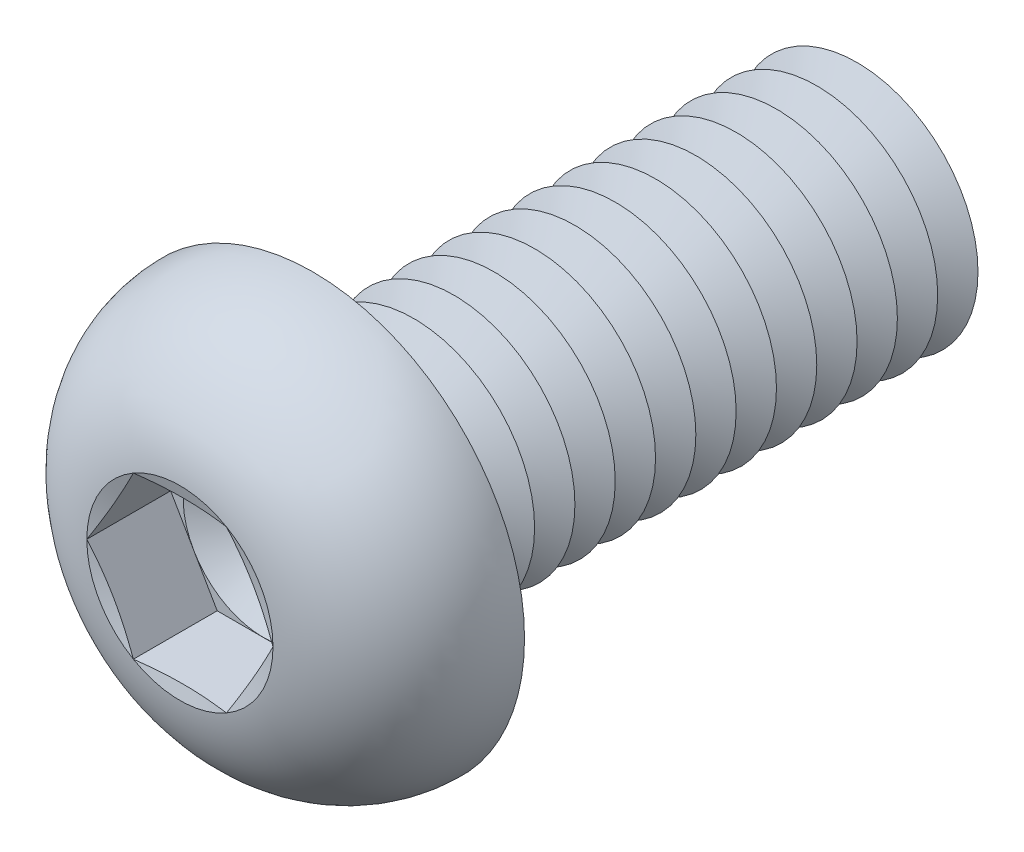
from build123d import *

# Parameters (mm, degrees)
FILLET1_R          = 0.5
LPATTERN1_COUNT    = 14
LPATTERN1_PITCH    = 1
CUT_EXTRUDE1_DEPTH = 2.08


with BuildPart() as part:
    # Sketch1 → Revolve1 (revolve)
    with BuildSketch(Plane(origin=(0, 0, 0), x_dir=(0, 0, -1), z_dir=(1, 0, 0)), mode=Mode.PRIVATE) as revolve1_sk:
        with BuildLine():
            Line((0, 3), (0, 5.25))
            ThreePointArc((0, 5.25), (-2.210041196, 4.408189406), (-3.3, 2.3094))
            Line((-3.3, 2.3094), (-2.990599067, 1.1547))
            Line((-2.990599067, 1.1547), (-3.3, 1.1547))
            Line((-3.3, 1.1547), (-3.3, 0))
            Line((-3.3, 0), (14, 0))
            Line((14, 0), (14, 3))
            Line((14, 3), (0, 3))
        make_face()
    revolve(revolve1_sk.sketch.rotate(Axis((0, 0, -14), (0, 0, 1)), 90), axis=Axis((0, 0, -14), (0, 0, 1)))

    # Fillet1
    fillet1_edges = [part.edges().sort_by_distance(p)[0] for p in [
        (3, 0, 0),
    ]]
    fillet(fillet1_edges, radius=FILLET1_R)

    # Sketch2 → Cut-Revolve1 (revolve, cut)
    with BuildSketch(Plane(origin=(0, 0, 0), x_dir=(0, 0, -1), z_dir=(1, 0, 0)), mode=Mode.PRIVATE) as cut_revolve1_sk:
        Polygon((13.5, 3), (14.5, 3), (14, 2.133974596), align=None)
    cut_revolve1 = revolve(cut_revolve1_sk.sketch.rotate(Axis((0, 0, -14), (0, 0, -1)), 270), axis=Axis((0, 0, -14), (0, 0, -1)), mode=Mode.SUBTRACT)

    # LPattern1: Cut-Revolve1 ×14
    with Locations(*[(0, 0, i * LPATTERN1_PITCH) for i in range(1, LPATTERN1_COUNT)]):
        add(cut_revolve1, mode=Mode.SUBTRACT)

    # Sketch3 → Cut-Extrude1 (cut)
    with BuildSketch(Plane.XY.offset(3.3)):
        Polygon((1.1547, 1.999999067), (-1.1547, 1.999999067), (-2.3094, 0), (-1.1547, -1.999999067), (1.1547, -1.999999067), (2.3094, 0), align=None)
    extrude(amount=-CUT_EXTRUDE1_DEPTH, mode=Mode.SUBTRACT)

    # Cut-Extrude2 cone 1 section (on through the dimple's axis) → Cut-Extrude2 (revolve, cut)
    with BuildSketch(Plane(origin=(0, 0, 1.22), x_dir=(0, -1, 0), z_dir=(1, 0, 0))):
        Polygon((0, 0), (1.999999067, 0), (0, 1.1547), align=None)
    revolve(axis=Axis((0, 0, 1.22), (0, 0, -1)), mode=Mode.SUBTRACT)


solid = part.part
